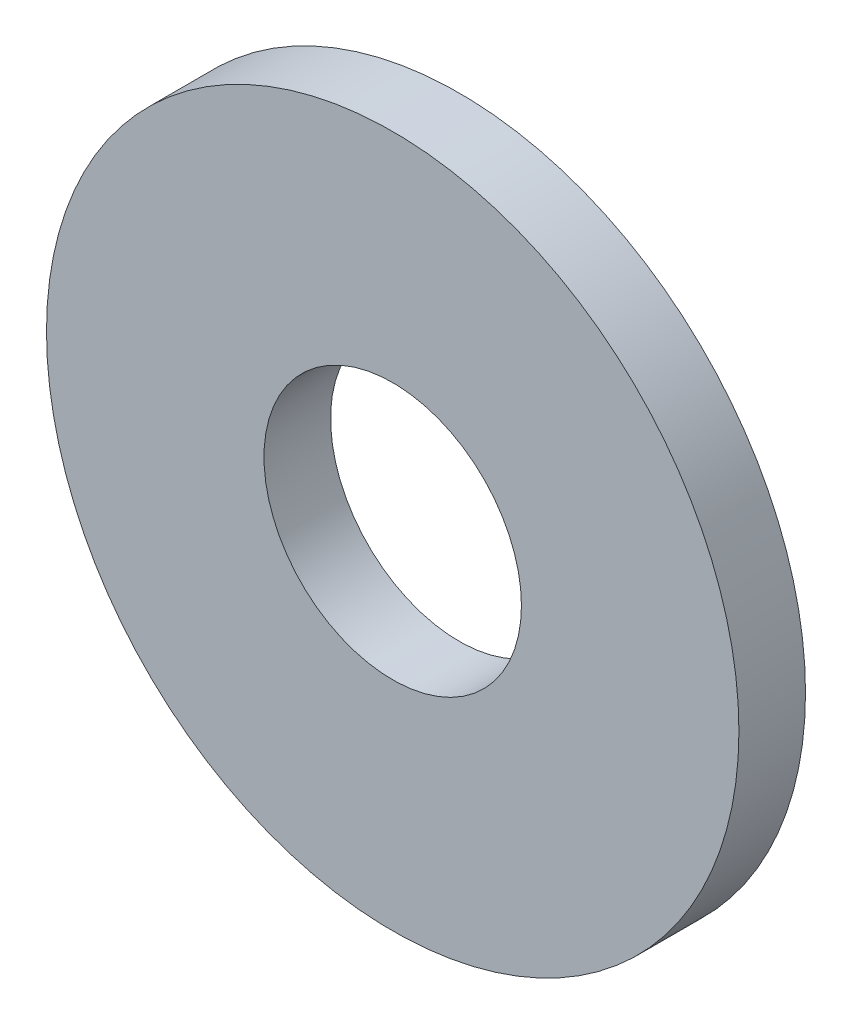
from build123d import *

# Parameters (mm, degrees)
SKETCH1_R             = 3.9624
BOSS_EXTRUDE1_DEPTH   = 0.762
F_4_CLEARANCE_HOLE1_D = 2.9464


with BuildPart() as part:
    # Sketch1 → Boss-Extrude1 (new body)
    with BuildSketch(Plane.XY):
        with Locations(Location((0, 0, 0), (0, 0, 180))):
            Circle(SKETCH1_R)
    extrude(amount=BOSS_EXTRUDE1_DEPTH)

    # 4 Clearance Hole1 (through all)
    with Locations(Plane.XY.offset(0.762)):
        with Locations((0, 0)):
            Hole(F_4_CLEARANCE_HOLE1_D / 2)


solid = part.part
